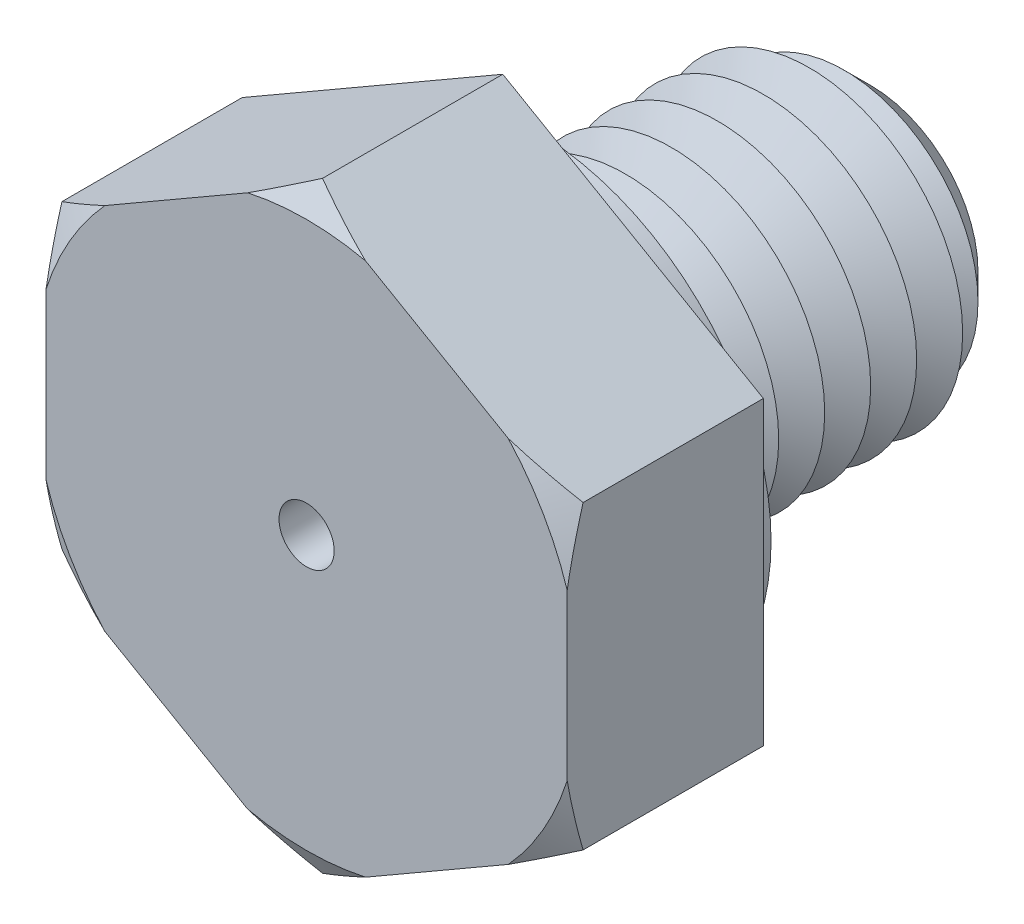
ISO-10303-21;
HEADER;
FILE_DESCRIPTION(('STEP AP214'),'2;1');
FILE_NAME('part.step','',(''),(''),'','','');
FILE_SCHEMA(('AUTOMOTIVE_DESIGN { 1 0 10303 214 1 1 1 1 }'));
ENDSEC;
DATA;
#1=APPLICATION_CONTEXT('core data for automotive mechanical design processes');
#2=APPLICATION_PROTOCOL_DEFINITION('international standard','automotive_design',2000,#1);
#3=PRODUCT_CONTEXT('',#1,'mechanical');
#4=PRODUCT('Part','Part','',(#3));
#5=PRODUCT_RELATED_PRODUCT_CATEGORY('part','',(#4));
#6=PRODUCT_DEFINITION_FORMATION('','',#4);
#7=PRODUCT_DEFINITION_CONTEXT('part definition',#1,'design');
#8=PRODUCT_DEFINITION('design','',#6,#7);
#9=PRODUCT_DEFINITION_SHAPE('','',#8);
#10=(LENGTH_UNIT() NAMED_UNIT(*) SI_UNIT(.MILLI.,.METRE.));
#11=(NAMED_UNIT(*) PLANE_ANGLE_UNIT() SI_UNIT($,.RADIAN.));
#12=(NAMED_UNIT(*) SI_UNIT($,.STERADIAN.) SOLID_ANGLE_UNIT());
#13=UNCERTAINTY_MEASURE_WITH_UNIT(LENGTH_MEASURE(1.E-05),#10,'distance_accuracy_value','');
#14=(GEOMETRIC_REPRESENTATION_CONTEXT(3) GLOBAL_UNCERTAINTY_ASSIGNED_CONTEXT((#13)) GLOBAL_UNIT_ASSIGNED_CONTEXT((#10,
#11,#12)) REPRESENTATION_CONTEXT('',''));
#15=CARTESIAN_POINT('',(0.,0.,0.));
#16=DIRECTION('',(0.,0.,1.));
#17=DIRECTION('',(1.,0.,0.));
#18=AXIS2_PLACEMENT_3D('',#15,#16,#17);
#19=CARTESIAN_POINT('',(8.5,4.90747728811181,6.4));
#20=DIRECTION('',(-0.5,-0.866025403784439,0.));
#21=DIRECTION('',(0.866025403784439,-0.5,0.));
#22=AXIS2_PLACEMENT_3D('',#19,#20,#21);
#23=PLANE('',#22);
#24=CARTESIAN_POINT('',(14.3974196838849,1.50260044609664,3.18954977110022));
#25=CARTESIAN_POINT('',(14.1303849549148,1.65677301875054,3.33361874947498));
#26=CARTESIAN_POINT('',(13.8627107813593,1.81131477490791,3.47613168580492));
#27=CARTESIAN_POINT('',(13.3258139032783,2.12129233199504,3.75731467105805));
#28=CARTESIAN_POINT('',(13.0565910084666,2.27672824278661,3.89598423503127));
#29=CARTESIAN_POINT('',(12.5155257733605,2.58911240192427,4.16915145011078));
#30=CARTESIAN_POINT('',(12.2436777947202,2.74606390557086,4.30363425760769));
#31=CARTESIAN_POINT('',(11.697943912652,3.06114350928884,4.56695627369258));
#32=CARTESIAN_POINT('',(11.4240580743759,3.21927157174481,4.69579566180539));
#33=CARTESIAN_POINT('',(10.8669438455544,3.54092162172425,4.94977636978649));
#34=CARTESIAN_POINT('',(10.5836547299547,3.70447866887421,5.07474091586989));
#35=CARTESIAN_POINT('',(10.0142178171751,4.03324322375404,5.31575754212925));
#36=CARTESIAN_POINT('',(9.72806988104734,4.19845081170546,5.43180918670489));
#37=CARTESIAN_POINT('',(9.15284957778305,4.53055440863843,5.6527883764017));
#38=CARTESIAN_POINT('',(8.86378033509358,4.69744861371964,5.75772666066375));
#39=CARTESIAN_POINT('',(8.28224800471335,5.03319646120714,5.95405449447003));
#40=CARTESIAN_POINT('',(7.98978536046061,5.20204984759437,6.04544579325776));
#41=CARTESIAN_POINT('',(7.29029341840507,5.60590170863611,6.24311258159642));
#42=CARTESIAN_POINT('',(6.88163396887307,5.84184135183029,6.34201308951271));
#43=CARTESIAN_POINT('',(6.2644717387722,6.1981601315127,6.46082851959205));
#44=CARTESIAN_POINT('',(6.05806549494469,6.31732883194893,6.49551015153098));
#45=CARTESIAN_POINT('',(5.64409758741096,6.55633331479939,6.55416143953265));
#46=CARTESIAN_POINT('',(5.43653593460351,6.67616909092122,6.57813119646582));
#47=CARTESIAN_POINT('',(5.02306823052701,6.914884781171,6.6144556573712));
#48=CARTESIAN_POINT('',(4.81717088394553,7.03375966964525,6.62694180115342));
#49=CARTESIAN_POINT('',(4.40509314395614,7.27167286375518,6.64040244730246));
#50=CARTESIAN_POINT('',(4.19891275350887,7.39071116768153,6.64137706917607));
#51=CARTESIAN_POINT('',(3.78675559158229,7.62867021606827,6.63178359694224));
#52=CARTESIAN_POINT('',(3.58077881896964,7.747590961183,6.62121556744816));
#53=CARTESIAN_POINT('',(3.16946579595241,7.9850626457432,6.58885652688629));
#54=CARTESIAN_POINT('',(2.96412965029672,8.10361352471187,6.56706376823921));
#55=CARTESIAN_POINT('',(2.47890311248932,8.38375919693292,6.50285520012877));
#56=CARTESIAN_POINT('',(2.19947000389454,8.54508997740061,6.45579627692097));
#57=CARTESIAN_POINT('',(1.6432817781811,8.86620539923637,6.34397240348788));
#58=CARTESIAN_POINT('',(1.36652705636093,9.02598981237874,6.27920487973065));
#59=CARTESIAN_POINT('',(0.815728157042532,9.34399370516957,6.13440902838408));
#60=CARTESIAN_POINT('',(0.541687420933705,9.50221119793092,6.05436342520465));
#61=CARTESIAN_POINT('',(-0.00331670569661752,9.81686947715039,5.88153285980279));
#62=CARTESIAN_POINT('',(-0.274280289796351,9.97331037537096,5.788748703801));
#63=CARTESIAN_POINT('',(-0.816522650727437,10.2863741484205,5.59147835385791));
#64=CARTESIAN_POINT('',(-1.08776675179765,10.4429770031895,5.48686595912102));
#65=CARTESIAN_POINT('',(-1.62738149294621,10.7545237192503,5.26886764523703));
#66=CARTESIAN_POINT('',(-1.89575390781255,10.9094686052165,5.15548754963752));
#67=CARTESIAN_POINT('',(-2.43005320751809,11.2179464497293,4.92150983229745));
#68=CARTESIAN_POINT('',(-2.69598059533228,11.3714796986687,4.80091373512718));
#69=CARTESIAN_POINT('',(-3.22575115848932,11.6773428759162,4.55376737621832));
#70=CARTESIAN_POINT('',(-3.48959429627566,11.829672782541,4.42721700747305));
#71=CARTESIAN_POINT('',(-3.9337259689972,12.0860923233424,4.20929972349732));
#72=CARTESIAN_POINT('',(-4.11449197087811,12.1904576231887,4.11922480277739));
#73=CARTESIAN_POINT('',(-4.47523725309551,12.3987340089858,3.93701701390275));
#74=CARTESIAN_POINT('',(-4.6552165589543,12.5026451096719,3.84488421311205));
#75=CARTESIAN_POINT('',(-5.01258669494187,12.7089728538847,3.65977671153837));
#76=CARTESIAN_POINT('',(-5.18998489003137,12.8113937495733,3.56682094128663));
#77=CARTESIAN_POINT('',(-5.54415606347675,13.0158745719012,3.3793246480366));
#78=CARTESIAN_POINT('',(-5.72092903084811,13.1179344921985,3.28478409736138));
#79=CARTESIAN_POINT('',(-5.89741968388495,13.2198314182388,3.18954977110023));
#80=B_SPLINE_CURVE_WITH_KNOTS('',3,(#24,#25,#26,#27,#28,#29,#30,#31,#32,#33,#34,#35,#36,#37,#38,
#39,#40,#41,#42,#43,#44,#45,#46,#47,#48,#49,#50,#51,#52,#53,#54,#55,#56,#57,#58,#59,#60,#61,#62,
#63,#64,#65,#66,#67,#68,#69,#70,#71,#72,#73,#74,#75,#76,#77,#78,#79),.UNSPECIFIED.,.F.,.F.,(4,2,
2,2,2,2,2,2,2,2,2,2,2,2,2,2,2,2,2,2,2,2,2,2,2,2,2,4),(0.,1.02103660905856,2.04220146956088,
3.06664888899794,4.09106369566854,5.1414707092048,6.19192902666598,7.24136281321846,
8.29066097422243,9.73548564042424,10.45782862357,11.1801648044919,11.8941264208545,
12.6080806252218,13.3220308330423,14.036092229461,15.0137259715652,15.9915018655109,
16.9703899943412,17.9492161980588,18.939699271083,19.9295300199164,20.9191523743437,
21.9087925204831,22.5907917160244,23.272768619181,23.947601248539,24.622445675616),.UNSPECIFIED.);
#81=CARTESIAN_POINT('',(8.5,4.90747728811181,5.88038475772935));
#82=VERTEX_POINT('',#81);
#83=CARTESIAN_POINT('',(6.57804882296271,6.01711631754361,6.4));
#84=VERTEX_POINT('',#83);
#85=EDGE_CURVE('E132',#82,#84,#80,.T.);
#86=ORIENTED_EDGE('',*,*,#85,.F.);
#87=DIRECTION('',(0.,0.,-1.));
#88=VECTOR('',#87,1.);
#89=CARTESIAN_POINT('',(8.5,4.90747728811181,6.4));
#90=LINE('',#89,#88);
#91=CARTESIAN_POINT('',(8.5,4.90747728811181,0.));
#92=VERTEX_POINT('',#91);
#93=EDGE_CURVE('E144',#82,#92,#90,.T.);
#94=ORIENTED_EDGE('',*,*,#93,.T.);
#95=DIRECTION('',(-0.866025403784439,0.5,0.));
#96=VECTOR('',#95,1.);
#97=CARTESIAN_POINT('',(8.5,4.90747728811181,0.));
#98=LINE('',#97,#96);
#99=CARTESIAN_POINT('',(0.,9.81495457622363,0.));
#100=VERTEX_POINT('',#99);
#101=EDGE_CURVE('E256',#92,#100,#98,.T.);
#102=ORIENTED_EDGE('',*,*,#101,.T.);
#103=DIRECTION('',(0.,0.,-1.));
#104=VECTOR('',#103,1.);
#105=CARTESIAN_POINT('',(0.,9.81495457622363,6.4));
#106=LINE('',#105,#104);
#107=CARTESIAN_POINT('',(0.,9.81495457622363,5.88038475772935));
#108=VERTEX_POINT('',#107);
#109=EDGE_CURVE('E177',#108,#100,#106,.T.);
#110=ORIENTED_EDGE('',*,*,#109,.F.);
#111=CARTESIAN_POINT('',(1.92195117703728,8.70531554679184,6.4));
#112=VERTEX_POINT('',#111);
#113=EDGE_CURVE('E151',#112,#108,#80,.T.);
#114=ORIENTED_EDGE('',*,*,#113,.F.);
#115=DIRECTION('',(-0.866025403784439,0.5,0.));
#116=VECTOR('',#115,1.);
#117=CARTESIAN_POINT('',(8.5,4.90747728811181,6.4));
#118=LINE('',#117,#116);
#119=EDGE_CURVE('E148',#84,#112,#118,.T.);
#120=ORIENTED_EDGE('',*,*,#119,.F.);
#121=EDGE_LOOP('',(#86,#94,#102,#110,#114,#120));
#122=FACE_BOUND('',#121,.T.);
#123=ADVANCED_FACE('F39',(#122),#23,.F.);
#124=CARTESIAN_POINT('',(0.,9.81495457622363,6.4));
#125=DIRECTION('',(0.5,-0.866025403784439,0.));
#126=DIRECTION('',(0.866025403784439,0.5,0.));
#127=AXIS2_PLACEMENT_3D('',#124,#125,#126);
#128=PLANE('',#127);
#129=CARTESIAN_POINT('',(5.89741968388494,13.2198314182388,3.18954977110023));
#130=CARTESIAN_POINT('',(5.63038495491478,13.0656588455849,3.33361874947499));
#131=CARTESIAN_POINT('',(5.36271078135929,12.9111170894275,3.47613168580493));
#132=CARTESIAN_POINT('',(4.82581390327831,12.6011395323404,3.75731467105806));
#133=CARTESIAN_POINT('',(4.55659100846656,12.4457036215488,3.89598423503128));
#134=CARTESIAN_POINT('',(4.01552577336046,12.1333194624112,4.16915145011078));
#135=CARTESIAN_POINT('',(3.74367779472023,11.9763679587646,4.30363425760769));
#136=CARTESIAN_POINT('',(3.19794391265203,11.6612883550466,4.56695627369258));
#137=CARTESIAN_POINT('',(2.92405807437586,11.5031602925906,4.69579566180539));
#138=CARTESIAN_POINT('',(2.3669438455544,11.1815102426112,4.9497763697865));
#139=CARTESIAN_POINT('',(2.08365472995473,11.0179531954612,5.0747409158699));
#140=CARTESIAN_POINT('',(1.51421781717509,10.6891886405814,5.31575754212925));
#141=CARTESIAN_POINT('',(1.22806988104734,10.52398105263,5.4318091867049));
#142=CARTESIAN_POINT('',(0.652849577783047,10.191877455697,5.6527883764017));
#143=CARTESIAN_POINT('',(0.363780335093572,10.0249832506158,5.75772666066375));
#144=CARTESIAN_POINT('',(-0.21775199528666,9.6892354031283,5.95405449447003));
#145=CARTESIAN_POINT('',(-0.510214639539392,9.52038201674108,6.04544579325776));
#146=CARTESIAN_POINT('',(-1.20970658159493,9.11653015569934,6.24311258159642));
#147=CARTESIAN_POINT('',(-1.61836603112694,8.88059051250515,6.34201308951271));
#148=CARTESIAN_POINT('',(-2.2355282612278,8.52427173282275,6.46082851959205));
#149=CARTESIAN_POINT('',(-2.44193450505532,8.40510303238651,6.49551015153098));
#150=CARTESIAN_POINT('',(-2.85590241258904,8.16609854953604,6.55416143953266));
#151=CARTESIAN_POINT('',(-3.0634640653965,8.04626277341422,6.57813119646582));
#152=CARTESIAN_POINT('',(-3.47693176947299,7.80754708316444,6.6144556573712));
#153=CARTESIAN_POINT('',(-3.68282911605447,7.68867219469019,6.62694180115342));
#154=CARTESIAN_POINT('',(-4.09490685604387,7.45075900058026,6.64040244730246));
#155=CARTESIAN_POINT('',(-4.30108724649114,7.33172069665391,6.64137706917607));
#156=CARTESIAN_POINT('',(-4.71324440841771,7.09376164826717,6.63178359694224));
#157=CARTESIAN_POINT('',(-4.91922118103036,6.97484090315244,6.62121556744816));
#158=CARTESIAN_POINT('',(-5.3305342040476,6.73736921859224,6.58885652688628));
#159=CARTESIAN_POINT('',(-5.53587034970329,6.61881833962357,6.5670637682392));
#160=CARTESIAN_POINT('',(-6.02109688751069,6.33867266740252,6.50285520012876));
#161=CARTESIAN_POINT('',(-6.30052999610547,6.17734188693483,6.45579627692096));
#162=CARTESIAN_POINT('',(-6.85671822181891,5.85622646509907,6.34397240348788));
#163=CARTESIAN_POINT('',(-7.13347294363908,5.6964420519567,6.27920487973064));
#164=CARTESIAN_POINT('',(-7.68427184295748,5.37843815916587,6.13440902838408));
#165=CARTESIAN_POINT('',(-7.9583125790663,5.22022066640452,6.05436342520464));
#166=CARTESIAN_POINT('',(-8.50331670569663,4.90556238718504,5.88153285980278));
#167=CARTESIAN_POINT('',(-8.77428028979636,4.74912148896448,5.78874870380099));
#168=CARTESIAN_POINT('',(-9.31652265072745,4.4360577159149,5.59147835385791));
#169=CARTESIAN_POINT('',(-9.58776675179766,4.27945486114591,5.48686595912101));
#170=CARTESIAN_POINT('',(-10.1273814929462,3.9679081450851,5.26886764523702));
#171=CARTESIAN_POINT('',(-10.3957539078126,3.81296325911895,5.15548754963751));
#172=CARTESIAN_POINT('',(-10.9300532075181,3.50448541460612,4.92150983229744));
#173=CARTESIAN_POINT('',(-11.1959805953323,3.35095216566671,4.80091373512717));
#174=CARTESIAN_POINT('',(-11.7257511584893,3.04508898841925,4.55376737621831));
#175=CARTESIAN_POINT('',(-11.9895942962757,2.89275908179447,4.42721700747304));
#176=CARTESIAN_POINT('',(-12.4337259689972,2.63633954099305,4.20929972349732));
#177=CARTESIAN_POINT('',(-12.6144919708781,2.53197424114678,4.11922480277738));
#178=CARTESIAN_POINT('',(-12.9752372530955,2.32369785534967,3.93701701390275));
#179=CARTESIAN_POINT('',(-13.1552165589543,2.21978675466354,3.84488421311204));
#180=CARTESIAN_POINT('',(-13.5125866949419,2.01345901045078,3.65977671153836));
#181=CARTESIAN_POINT('',(-13.6899848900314,1.91103811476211,3.56682094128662));
#182=CARTESIAN_POINT('',(-14.0441560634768,1.70655729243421,3.37932464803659));
#183=CARTESIAN_POINT('',(-14.2209290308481,1.60449737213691,3.28478409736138));
#184=CARTESIAN_POINT('',(-14.3974196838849,1.50260044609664,3.18954977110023));
#185=B_SPLINE_CURVE_WITH_KNOTS('',3,(#129,#130,#131,#132,#133,#134,#135,#136,#137,#138,#139,
#140,#141,#142,#143,#144,#145,#146,#147,#148,#149,#150,#151,#152,#153,#154,#155,#156,#157,#158,
#159,#160,#161,#162,#163,#164,#165,#166,#167,#168,#169,#170,#171,#172,#173,#174,#175,#176,#177,
#178,#179,#180,#181,#182,#183,#184),.UNSPECIFIED.,.F.,.F.,(4,2,2,2,2,2,2,2,2,2,2,2,2,2,2,2,2,2,
2,2,2,2,2,2,2,2,2,4),(0.,1.02103660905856,2.04220146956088,3.06664888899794,4.09106369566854,
5.14147070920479,6.19192902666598,7.24136281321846,8.29066097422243,9.73548564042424,
10.45782862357,11.1801648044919,11.8941264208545,12.6080806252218,13.3220308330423,
14.036092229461,15.0137259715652,15.991501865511,16.9703899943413,17.9492161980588,
18.939699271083,19.9295300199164,20.9191523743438,21.9087925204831,22.5907917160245,
23.272768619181,23.947601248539,24.622445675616),.UNSPECIFIED.);
#186=CARTESIAN_POINT('',(-1.92195117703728,8.70531554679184,6.4));
#187=VERTEX_POINT('',#186);
#188=EDGE_CURVE('E310',#108,#187,#185,.T.);
#189=ORIENTED_EDGE('',*,*,#188,.F.);
#190=ORIENTED_EDGE('',*,*,#109,.T.);
#191=DIRECTION('',(-0.866025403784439,-0.5,0.));
#192=VECTOR('',#191,1.);
#193=CARTESIAN_POINT('',(0.,9.81495457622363,0.));
#194=LINE('',#193,#192);
#195=CARTESIAN_POINT('',(-8.5,4.90747728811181,0.));
#196=VERTEX_POINT('',#195);
#197=EDGE_CURVE('E276',#100,#196,#194,.T.);
#198=ORIENTED_EDGE('',*,*,#197,.T.);
#199=DIRECTION('',(0.,0.,-1.));
#200=VECTOR('',#199,1.);
#201=CARTESIAN_POINT('',(-8.5,4.90747728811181,6.4));
#202=LINE('',#201,#200);
#203=CARTESIAN_POINT('',(-8.5,4.90747728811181,5.88038475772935));
#204=VERTEX_POINT('',#203);
#205=EDGE_CURVE('E174',#204,#196,#202,.T.);
#206=ORIENTED_EDGE('',*,*,#205,.F.);
#207=CARTESIAN_POINT('',(-6.57804882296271,6.01711631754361,6.4));
#208=VERTEX_POINT('',#207);
#209=EDGE_CURVE('E304',#208,#204,#185,.T.);
#210=ORIENTED_EDGE('',*,*,#209,.F.);
#211=DIRECTION('',(-0.866025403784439,-0.5,0.));
#212=VECTOR('',#211,1.);
#213=CARTESIAN_POINT('',(0.,9.81495457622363,6.4));
#214=LINE('',#213,#212);
#215=EDGE_CURVE('E259',#187,#208,#214,.T.);
#216=ORIENTED_EDGE('',*,*,#215,.F.);
#217=EDGE_LOOP('',(#189,#190,#198,#206,#210,#216));
#218=FACE_BOUND('',#217,.T.);
#219=ADVANCED_FACE('F360',(#218),#128,.F.);
#220=CARTESIAN_POINT('',(-8.5,4.90747728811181,6.4));
#221=DIRECTION('',(1.,0.,0.));
#222=DIRECTION('',(0.,0.,-1.));
#223=AXIS2_PLACEMENT_3D('',#220,#221,#222);
#224=PLANE('',#223);
#225=CARTESIAN_POINT('',(-8.5,10.8048969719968,3.60988571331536));
#226=CARTESIAN_POINT('',(-8.5,10.4978348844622,3.74918346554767));
#227=CARTESIAN_POINT('',(-8.5,10.189932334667,3.88666386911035));
#228=CARTESIAN_POINT('',(-8.5,9.57208629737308,4.15710808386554));
#229=CARTESIAN_POINT('',(-8.5,9.26214245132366,4.29007107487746));
#230=CARTESIAN_POINT('',(-8.5,8.6386633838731,4.55109231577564));
#231=CARTESIAN_POINT('',(-8.5,8.32511856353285,4.67912772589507));
#232=CARTESIAN_POINT('',(-8.5,7.69537699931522,4.92848462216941));
#233=CARTESIAN_POINT('',(-8.5,7.37918037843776,5.04980641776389));
#234=CARTESIAN_POINT('',(-8.5,6.74517674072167,5.28371307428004));
#235=CARTESIAN_POINT('',(-8.5,6.42738342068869,5.39633487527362));
#236=CARTESIAN_POINT('',(-8.5,5.78839893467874,5.61161420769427));
#237=CARTESIAN_POINT('',(-8.5,5.46720760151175,5.7142712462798));
#238=CARTESIAN_POINT('',(-8.5,4.82159629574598,5.90726308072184));
#239=CARTESIAN_POINT('',(-8.5,4.49718135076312,5.99761456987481));
#240=CARTESIAN_POINT('',(-8.5,3.84456693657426,6.16359045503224));
#241=CARTESIAN_POINT('',(-8.5,3.51636763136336,6.23921548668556));
#242=CARTESIAN_POINT('',(-8.5,2.94974096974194,6.35404738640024));
#243=CARTESIAN_POINT('',(-8.5,2.7121746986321,6.39750509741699));
#244=CARTESIAN_POINT('',(-8.5,2.23545236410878,6.47441576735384));
#245=CARTESIAN_POINT('',(-8.5,1.99629657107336,6.50787038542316));
#246=CARTESIAN_POINT('',(-8.5,1.51674855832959,6.56389930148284));
#247=CARTESIAN_POINT('',(-8.5,1.27635657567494,6.58647561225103));
#248=CARTESIAN_POINT('',(-8.5,0.794760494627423,6.62010098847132));
#249=CARTESIAN_POINT('',(-8.5,0.553556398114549,6.63115008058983));
#250=CARTESIAN_POINT('',(-8.5,0.0710159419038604,6.64137634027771));
#251=CARTESIAN_POINT('',(-8.5,-0.170320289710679,6.64055949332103));
#252=CARTESIAN_POINT('',(-8.5,-0.65265778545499,6.62709447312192));
#253=CARTESIAN_POINT('',(-8.5,-0.893659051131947,6.6144463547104));
#254=CARTESIAN_POINT('',(-8.5,-1.37480632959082,6.57770491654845));
#255=CARTESIAN_POINT('',(-8.5,-1.61495224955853,6.55361039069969));
#256=CARTESIAN_POINT('',(-8.5,-2.09391419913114,6.49466927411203));
#257=CARTESIAN_POINT('',(-8.5,-2.33273017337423,6.4598222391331));
#258=CARTESIAN_POINT('',(-8.5,-2.92716537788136,6.36046793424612));
#259=CARTESIAN_POINT('',(-8.5,-3.28176466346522,6.28983043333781));
#260=CARTESIAN_POINT('',(-8.5,-3.98672843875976,6.12983266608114));
#261=CARTESIAN_POINT('',(-8.5,-4.3370917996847,6.0404675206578));
#262=CARTESIAN_POINT('',(-8.5,-5.0342542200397,5.84616571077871));
#263=CARTESIAN_POINT('',(-8.5,-5.3810438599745,5.74119557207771));
#264=CARTESIAN_POINT('',(-8.5,-6.07054103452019,5.51879279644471));
#265=CARTESIAN_POINT('',(-8.5,-6.41324885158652,5.40136102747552));
#266=CARTESIAN_POINT('',(-8.5,-7.09891821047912,5.15508322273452));
#267=CARTESIAN_POINT('',(-8.5,-7.44183833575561,5.02612259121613));
#268=CARTESIAN_POINT('',(-8.5,-8.12447486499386,4.75996128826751));
#269=CARTESIAN_POINT('',(-8.5,-8.46419106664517,4.62276010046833));
#270=CARTESIAN_POINT('',(-8.5,-9.13876623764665,4.34260011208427));
#271=CARTESIAN_POINT('',(-8.5,-9.47364225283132,4.19968216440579));
#272=CARTESIAN_POINT('',(-8.5,-10.1409696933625,3.90850505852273));
#273=CARTESIAN_POINT('',(-8.5,-10.4734216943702,3.76024722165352));
#274=CARTESIAN_POINT('',(-8.5,-10.8048969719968,3.60988571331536));
#275=B_SPLINE_CURVE_WITH_KNOTS('',3,(#225,#226,#227,#228,#229,#230,#231,#232,#233,#234,#235,
#236,#237,#238,#239,#240,#241,#242,#243,#244,#245,#246,#247,#248,#249,#250,#251,#252,#253,#254,
#255,#256,#257,#258,#259,#260,#261,#262,#263,#264,#265,#266,#267,#268,#269,#270,#271,#272,#273,
#274),.UNSPECIFIED.,.F.,.F.,(4,2,2,2,2,2,2,2,2,2,2,2,2,2,2,2,2,2,2,2,2,2,2,2,4),(0.,
1.01155870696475,2.02330010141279,3.03927305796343,4.05519914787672,5.06654285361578,
6.07793655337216,7.08794426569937,8.09790837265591,8.82224854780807,9.5464685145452,
10.2705544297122,10.9946386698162,11.7183576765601,12.4420733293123,13.1658652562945,
13.8896870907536,14.9737367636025,16.0580692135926,17.1447621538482,18.2313794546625,
19.3303511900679,20.4293918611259,21.5216359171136,22.6136115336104),.UNSPECIFIED.);
#276=CARTESIAN_POINT('',(-8.5,2.68819922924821,6.4));
#277=VERTEX_POINT('',#276);
#278=EDGE_CURVE('E303',#204,#277,#275,.T.);
#279=ORIENTED_EDGE('',*,*,#278,.F.);
#280=ORIENTED_EDGE('',*,*,#205,.T.);
#281=DIRECTION('',(0.,-1.,0.));
#282=VECTOR('',#281,1.);
#283=CARTESIAN_POINT('',(-8.5,4.90747728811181,0.));
#284=LINE('',#283,#282);
#285=CARTESIAN_POINT('',(-8.5,-4.90747728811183,0.));
#286=VERTEX_POINT('',#285);
#287=EDGE_CURVE('E280',#196,#286,#284,.T.);
#288=ORIENTED_EDGE('',*,*,#287,.T.);
#289=DIRECTION('',(0.,0.,-1.));
#290=VECTOR('',#289,1.);
#291=CARTESIAN_POINT('',(-8.5,-4.90747728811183,6.4));
#292=LINE('',#291,#290);
#293=CARTESIAN_POINT('',(-8.49999999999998,-4.90747728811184,5.88038475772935));
#294=VERTEX_POINT('',#293);
#295=EDGE_CURVE('E172',#294,#286,#292,.T.);
#296=ORIENTED_EDGE('',*,*,#295,.F.);
#297=CARTESIAN_POINT('',(-8.5,-2.68819922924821,6.4));
#298=VERTEX_POINT('',#297);
#299=EDGE_CURVE('E305',#298,#294,#275,.T.);
#300=ORIENTED_EDGE('',*,*,#299,.F.);
#301=DIRECTION('',(0.,-1.,0.));
#302=VECTOR('',#301,1.);
#303=CARTESIAN_POINT('',(-8.5,4.90747728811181,6.4));
#304=LINE('',#303,#302);
#305=EDGE_CURVE('E263',#277,#298,#304,.T.);
#306=ORIENTED_EDGE('',*,*,#305,.F.);
#307=EDGE_LOOP('',(#279,#280,#288,#296,#300,#306));
#308=FACE_BOUND('',#307,.T.);
#309=ADVANCED_FACE('F356',(#308),#224,.F.);
#310=CARTESIAN_POINT('',(-8.5,-4.90747728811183,6.4));
#311=DIRECTION('',(0.5,0.866025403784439,0.));
#312=DIRECTION('',(-0.866025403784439,0.5,0.));
#313=AXIS2_PLACEMENT_3D('',#310,#311,#312);
#314=PLANE('',#313);
#315=CARTESIAN_POINT('',(-14.3974196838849,-1.50260044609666,3.18954977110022));
#316=CARTESIAN_POINT('',(-14.1303849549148,-1.65677301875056,3.33361874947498));
#317=CARTESIAN_POINT('',(-13.8627107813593,-1.81131477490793,3.47613168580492));
#318=CARTESIAN_POINT('',(-13.3258139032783,-2.12129233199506,3.75731467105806));
#319=CARTESIAN_POINT('',(-13.0565910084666,-2.27672824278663,3.89598423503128));
#320=CARTESIAN_POINT('',(-12.5155257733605,-2.58911240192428,4.16915145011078));
#321=CARTESIAN_POINT('',(-12.2436777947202,-2.74606390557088,4.30363425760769));
#322=CARTESIAN_POINT('',(-11.697943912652,-3.06114350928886,4.56695627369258));
#323=CARTESIAN_POINT('',(-11.4240580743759,-3.21927157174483,4.69579566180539));
#324=CARTESIAN_POINT('',(-10.8669438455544,-3.54092162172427,4.94977636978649));
#325=CARTESIAN_POINT('',(-10.5836547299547,-3.70447866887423,5.07474091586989));
#326=CARTESIAN_POINT('',(-10.0142178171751,-4.03324322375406,5.31575754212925));
#327=CARTESIAN_POINT('',(-9.72806988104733,-4.19845081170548,5.43180918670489));
#328=CARTESIAN_POINT('',(-9.15284957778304,-4.53055440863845,5.65278837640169));
#329=CARTESIAN_POINT('',(-8.86378033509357,-4.69744861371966,5.75772666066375));
#330=CARTESIAN_POINT('',(-8.28224800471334,-5.03319646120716,5.95405449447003));
#331=CARTESIAN_POINT('',(-7.9897853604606,-5.20204984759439,6.04544579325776));
#332=CARTESIAN_POINT('',(-7.29029341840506,-5.60590170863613,6.24311258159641));
#333=CARTESIAN_POINT('',(-6.88163396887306,-5.84184135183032,6.34201308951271));
#334=CARTESIAN_POINT('',(-6.26447173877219,-6.19816013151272,6.46082851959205));
#335=CARTESIAN_POINT('',(-6.05806549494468,-6.31732883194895,6.49551015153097));
#336=CARTESIAN_POINT('',(-5.64409758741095,-6.55633331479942,6.55416143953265));
#337=CARTESIAN_POINT('',(-5.4365359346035,-6.67616909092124,6.57813119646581));
#338=CARTESIAN_POINT('',(-5.023068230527,-6.91488478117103,6.6144556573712));
#339=CARTESIAN_POINT('',(-4.81717088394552,-7.03375966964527,6.62694180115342));
#340=CARTESIAN_POINT('',(-4.40509314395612,-7.2716728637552,6.64040244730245));
#341=CARTESIAN_POINT('',(-4.19891275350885,-7.39071116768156,6.64137706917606));
#342=CARTESIAN_POINT('',(-3.78675559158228,-7.6286702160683,6.63178359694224));
#343=CARTESIAN_POINT('',(-3.58077881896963,-7.74759096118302,6.62121556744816));
#344=CARTESIAN_POINT('',(-3.16946579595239,-7.98506264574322,6.58885652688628));
#345=CARTESIAN_POINT('',(-2.9641296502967,-8.10361352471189,6.5670637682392));
#346=CARTESIAN_POINT('',(-2.4789031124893,-8.38375919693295,6.50285520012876));
#347=CARTESIAN_POINT('',(-2.19947000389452,-8.54508997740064,6.45579627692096));
#348=CARTESIAN_POINT('',(-1.64328177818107,-8.8662053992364,6.34397240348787));
#349=CARTESIAN_POINT('',(-1.36652705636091,-9.02598981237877,6.27920487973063));
#350=CARTESIAN_POINT('',(-0.815728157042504,-9.3439937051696,6.13440902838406));
#351=CARTESIAN_POINT('',(-0.541687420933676,-9.50221119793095,6.05436342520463));
#352=CARTESIAN_POINT('',(0.00331670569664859,-9.81686947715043,5.88153285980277));
#353=CARTESIAN_POINT('',(0.274280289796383,-9.973310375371,5.78874870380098));
#354=CARTESIAN_POINT('',(0.81652265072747,-10.2863741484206,5.59147835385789));
#355=CARTESIAN_POINT('',(1.08776675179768,-10.4429770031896,5.486865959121));
#356=CARTESIAN_POINT('',(1.62738149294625,-10.7545237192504,5.268867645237));
#357=CARTESIAN_POINT('',(1.89575390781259,-10.9094686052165,5.15548754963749));
#358=CARTESIAN_POINT('',(2.43005320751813,-11.2179464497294,4.92150983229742));
#359=CARTESIAN_POINT('',(2.69598059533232,-11.3714796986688,4.80091373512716));
#360=CARTESIAN_POINT('',(3.22575115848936,-11.6773428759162,4.55376737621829));
#361=CARTESIAN_POINT('',(3.48959429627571,-11.829672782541,4.42721700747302));
#362=CARTESIAN_POINT('',(3.93372596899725,-12.0860923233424,4.20929972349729));
#363=CARTESIAN_POINT('',(4.11449197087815,-12.1904576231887,4.11922480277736));
#364=CARTESIAN_POINT('',(4.47523725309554,-12.3987340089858,3.93701701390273));
#365=CARTESIAN_POINT('',(4.65521655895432,-12.5026451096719,3.84488421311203));
#366=CARTESIAN_POINT('',(5.01258669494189,-12.7089728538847,3.65977671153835));
#367=CARTESIAN_POINT('',(5.18998489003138,-12.8113937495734,3.56682094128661));
#368=CARTESIAN_POINT('',(5.54415606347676,-13.0158745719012,3.37932464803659));
#369=CARTESIAN_POINT('',(5.72092903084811,-13.1179344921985,3.28478409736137));
#370=CARTESIAN_POINT('',(5.89741968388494,-13.2198314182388,3.18954977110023));
#371=B_SPLINE_CURVE_WITH_KNOTS('',3,(#315,#316,#317,#318,#319,#320,#321,#322,#323,#324,#325,
#326,#327,#328,#329,#330,#331,#332,#333,#334,#335,#336,#337,#338,#339,#340,#341,#342,#343,#344,
#345,#346,#347,#348,#349,#350,#351,#352,#353,#354,#355,#356,#357,#358,#359,#360,#361,#362,#363,
#364,#365,#366,#367,#368,#369,#370),.UNSPECIFIED.,.F.,.F.,(4,2,2,2,2,2,2,2,2,2,2,2,2,2,2,2,2,2,
2,2,2,2,2,2,2,2,2,4),(0.,1.02103660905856,2.04220146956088,3.06664888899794,4.09106369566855,
5.1414707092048,6.19192902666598,7.24136281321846,8.29066097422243,9.73548564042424,
10.45782862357,11.1801648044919,11.8941264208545,12.6080806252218,13.3220308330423,
14.036092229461,15.0137259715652,15.991501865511,16.9703899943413,17.9492161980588,
18.939699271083,19.9295300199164,20.9191523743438,21.9087925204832,22.5907917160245,
23.272768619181,23.947601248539,24.622445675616),.UNSPECIFIED.);
#372=CARTESIAN_POINT('',(-6.57804882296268,-6.01711631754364,6.4));
#373=VERTEX_POINT('',#372);
#374=EDGE_CURVE('E309',#294,#373,#371,.T.);
#375=ORIENTED_EDGE('',*,*,#374,.F.);
#376=ORIENTED_EDGE('',*,*,#295,.T.);
#377=DIRECTION('',(0.866025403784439,-0.5,0.));
#378=VECTOR('',#377,1.);
#379=CARTESIAN_POINT('',(-8.5,-4.90747728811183,0.));
#380=LINE('',#379,#378);
#381=CARTESIAN_POINT('',(0.,-9.81495457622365,0.));
#382=VERTEX_POINT('',#381);
#383=EDGE_CURVE('E284',#286,#382,#380,.T.);
#384=ORIENTED_EDGE('',*,*,#383,.T.);
#385=DIRECTION('',(0.,0.,-1.));
#386=VECTOR('',#385,1.);
#387=CARTESIAN_POINT('',(0.,-9.81495457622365,6.4));
#388=LINE('',#387,#386);
#389=CARTESIAN_POINT('',(0.,-9.81495457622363,5.88038475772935));
#390=VERTEX_POINT('',#389);
#391=EDGE_CURVE('E162',#390,#382,#388,.T.);
#392=ORIENTED_EDGE('',*,*,#391,.F.);
#393=CARTESIAN_POINT('',(-1.92195117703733,-8.70531554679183,6.4));
#394=VERTEX_POINT('',#393);
#395=EDGE_CURVE('E344',#394,#390,#371,.T.);
#396=ORIENTED_EDGE('',*,*,#395,.F.);
#397=DIRECTION('',(0.866025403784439,-0.5,0.));
#398=VECTOR('',#397,1.);
#399=CARTESIAN_POINT('',(-8.5,-4.90747728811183,6.4));
#400=LINE('',#399,#398);
#401=EDGE_CURVE('E267',#373,#394,#400,.T.);
#402=ORIENTED_EDGE('',*,*,#401,.F.);
#403=EDGE_LOOP('',(#375,#376,#384,#392,#396,#402));
#404=FACE_BOUND('',#403,.T.);
#405=ADVANCED_FACE('F359',(#404),#314,.F.);
#406=CARTESIAN_POINT('',(0.,-9.81495457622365,6.4));
#407=DIRECTION('',(-0.5,0.866025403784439,0.));
#408=DIRECTION('',(-0.866025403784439,-0.5,0.));
#409=AXIS2_PLACEMENT_3D('',#406,#407,#408);
#410=PLANE('',#409);
#411=CARTESIAN_POINT('',(-5.89741968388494,-13.2198314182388,3.18954977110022));
#412=CARTESIAN_POINT('',(-5.63038495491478,-13.0656588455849,3.33361874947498));
#413=CARTESIAN_POINT('',(-5.36271078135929,-12.9111170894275,3.47613168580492));
#414=CARTESIAN_POINT('',(-4.8258139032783,-12.6011395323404,3.75731467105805));
#415=CARTESIAN_POINT('',(-4.55659100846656,-12.4457036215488,3.89598423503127));
#416=CARTESIAN_POINT('',(-4.01552577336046,-12.1333194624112,4.16915145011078));
#417=CARTESIAN_POINT('',(-3.74367779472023,-11.9763679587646,4.30363425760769));
#418=CARTESIAN_POINT('',(-3.19794391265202,-11.6612883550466,4.56695627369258));
#419=CARTESIAN_POINT('',(-2.92405807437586,-11.5031602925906,4.69579566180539));
#420=CARTESIAN_POINT('',(-2.36694384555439,-11.1815102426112,4.94977636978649));
#421=CARTESIAN_POINT('',(-2.08365472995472,-11.0179531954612,5.07474091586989));
#422=CARTESIAN_POINT('',(-1.51421781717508,-10.6891886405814,5.31575754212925));
#423=CARTESIAN_POINT('',(-1.22806988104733,-10.52398105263,5.43180918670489));
#424=CARTESIAN_POINT('',(-0.652849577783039,-10.191877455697,5.65278837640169));
#425=CARTESIAN_POINT('',(-0.363780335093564,-10.0249832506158,5.75772666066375));
#426=CARTESIAN_POINT('',(0.217751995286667,-9.68923540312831,5.95405449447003));
#427=CARTESIAN_POINT('',(0.5102146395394,-9.52038201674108,6.04544579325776));
#428=CARTESIAN_POINT('',(1.20970658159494,-9.11653015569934,6.24311258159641));
#429=CARTESIAN_POINT('',(1.61836603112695,-8.88059051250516,6.34201308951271));
#430=CARTESIAN_POINT('',(2.23552826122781,-8.52427173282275,6.46082851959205));
#431=CARTESIAN_POINT('',(2.44193450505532,-8.40510303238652,6.49551015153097));
#432=CARTESIAN_POINT('',(2.85590241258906,-8.16609854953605,6.55416143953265));
#433=CARTESIAN_POINT('',(3.06346406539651,-8.04626277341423,6.57813119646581));
#434=CARTESIAN_POINT('',(3.47693176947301,-7.80754708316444,6.61445565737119));
#435=CARTESIAN_POINT('',(3.68282911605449,-7.6886721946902,6.62694180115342));
#436=CARTESIAN_POINT('',(4.09490685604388,-7.45075900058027,6.64040244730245));
#437=CARTESIAN_POINT('',(4.30108724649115,-7.33172069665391,6.64137706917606));
#438=CARTESIAN_POINT('',(4.71324440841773,-7.09376164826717,6.63178359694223));
#439=CARTESIAN_POINT('',(4.91922118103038,-6.97484090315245,6.62121556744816));
#440=CARTESIAN_POINT('',(5.33053420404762,-6.73736921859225,6.58885652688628));
#441=CARTESIAN_POINT('',(5.5358703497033,-6.61881833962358,6.5670637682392));
#442=CARTESIAN_POINT('',(6.02109688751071,-6.33867266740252,6.50285520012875));
#443=CARTESIAN_POINT('',(6.30052999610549,-6.17734188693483,6.45579627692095));
#444=CARTESIAN_POINT('',(6.85671822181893,-5.85622646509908,6.34397240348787));
#445=CARTESIAN_POINT('',(7.1334729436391,-5.6964420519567,6.27920487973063));
#446=CARTESIAN_POINT('',(7.6842718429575,-5.37843815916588,6.13440902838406));
#447=CARTESIAN_POINT('',(7.95831257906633,-5.22022066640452,6.05436342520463));
#448=CARTESIAN_POINT('',(8.50331670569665,-4.90556238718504,5.88153285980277));
#449=CARTESIAN_POINT('',(8.77428028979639,-4.74912148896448,5.78874870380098));
#450=CARTESIAN_POINT('',(9.31652265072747,-4.4360577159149,5.59147835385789));
#451=CARTESIAN_POINT('',(9.58776675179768,-4.27945486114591,5.486865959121));
#452=CARTESIAN_POINT('',(10.1273814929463,-3.9679081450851,5.268867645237));
#453=CARTESIAN_POINT('',(10.3957539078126,-3.81296325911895,5.15548754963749));
#454=CARTESIAN_POINT('',(10.9300532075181,-3.50448541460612,4.92150983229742));
#455=CARTESIAN_POINT('',(11.1959805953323,-3.35095216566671,4.80091373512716));
#456=CARTESIAN_POINT('',(11.7257511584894,-3.04508898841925,4.5537673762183));
#457=CARTESIAN_POINT('',(11.9895942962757,-2.89275908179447,4.42721700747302));
#458=CARTESIAN_POINT('',(12.4337259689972,-2.63633954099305,4.20929972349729));
#459=CARTESIAN_POINT('',(12.6144919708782,-2.53197424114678,4.11922480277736));
#460=CARTESIAN_POINT('',(12.9752372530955,-2.32369785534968,3.93701701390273));
#461=CARTESIAN_POINT('',(13.1552165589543,-2.21978675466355,3.84488421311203));
#462=CARTESIAN_POINT('',(13.5125866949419,-2.0134590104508,3.65977671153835));
#463=CARTESIAN_POINT('',(13.6899848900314,-1.91103811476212,3.56682094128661));
#464=CARTESIAN_POINT('',(14.0441560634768,-1.70655729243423,3.37932464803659));
#465=CARTESIAN_POINT('',(14.2209290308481,-1.60449737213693,3.28478409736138));
#466=CARTESIAN_POINT('',(14.3974196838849,-1.50260044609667,3.18954977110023));
#467=B_SPLINE_CURVE_WITH_KNOTS('',3,(#411,#412,#413,#414,#415,#416,#417,#418,#419,#420,#421,
#422,#423,#424,#425,#426,#427,#428,#429,#430,#431,#432,#433,#434,#435,#436,#437,#438,#439,#440,
#441,#442,#443,#444,#445,#446,#447,#448,#449,#450,#451,#452,#453,#454,#455,#456,#457,#458,#459,
#460,#461,#462,#463,#464,#465,#466),.UNSPECIFIED.,.F.,.F.,(4,2,2,2,2,2,2,2,2,2,2,2,2,2,2,2,2,2,
2,2,2,2,2,2,2,2,2,4),(0.,1.02103660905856,2.04220146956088,3.06664888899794,4.09106369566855,
5.1414707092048,6.19192902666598,7.24136281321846,8.29066097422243,9.73548564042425,
10.45782862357,11.1801648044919,11.8941264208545,12.6080806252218,13.3220308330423,
14.036092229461,15.0137259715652,15.991501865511,16.9703899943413,17.9492161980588,
18.939699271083,19.9295300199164,20.9191523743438,21.9087925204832,22.5907917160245,
23.272768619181,23.947601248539,24.622445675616),.UNSPECIFIED.);
#468=CARTESIAN_POINT('',(1.92195117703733,-8.70531554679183,6.4));
#469=VERTEX_POINT('',#468);
#470=EDGE_CURVE('E64',#390,#469,#467,.T.);
#471=ORIENTED_EDGE('',*,*,#470,.F.);
#472=ORIENTED_EDGE('',*,*,#391,.T.);
#473=DIRECTION('',(0.866025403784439,0.5,0.));
#474=VECTOR('',#473,1.);
#475=CARTESIAN_POINT('',(0.,-9.81495457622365,0.));
#476=LINE('',#475,#474);
#477=CARTESIAN_POINT('',(8.5,-4.90747728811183,0.));
#478=VERTEX_POINT('',#477);
#479=EDGE_CURVE('E287',#382,#478,#476,.T.);
#480=ORIENTED_EDGE('',*,*,#479,.T.);
#481=DIRECTION('',(0.,0.,-1.));
#482=VECTOR('',#481,1.);
#483=CARTESIAN_POINT('',(8.5,-4.90747728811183,6.4));
#484=LINE('',#483,#482);
#485=CARTESIAN_POINT('',(8.5,-4.90747728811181,5.88038475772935));
#486=VERTEX_POINT('',#485);
#487=EDGE_CURVE('E157',#486,#478,#484,.T.);
#488=ORIENTED_EDGE('',*,*,#487,.F.);
#489=CARTESIAN_POINT('',(6.57804882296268,-6.01711631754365,6.4));
#490=VERTEX_POINT('',#489);
#491=EDGE_CURVE('E299',#490,#486,#467,.T.);
#492=ORIENTED_EDGE('',*,*,#491,.F.);
#493=DIRECTION('',(0.866025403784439,0.5,0.));
#494=VECTOR('',#493,1.);
#495=CARTESIAN_POINT('',(0.,-9.81495457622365,6.4));
#496=LINE('',#495,#494);
#497=EDGE_CURVE('E165',#469,#490,#496,.T.);
#498=ORIENTED_EDGE('',*,*,#497,.F.);
#499=EDGE_LOOP('',(#471,#472,#480,#488,#492,#498));
#500=FACE_BOUND('',#499,.T.);
#501=ADVANCED_FACE('F435',(#500),#410,.F.);
#502=CARTESIAN_POINT('',(8.5,-4.90747728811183,6.4));
#503=DIRECTION('',(-1.,0.,0.));
#504=DIRECTION('',(0.,0.,1.));
#505=AXIS2_PLACEMENT_3D('',#502,#503,#504);
#506=PLANE('',#505);
#507=CARTESIAN_POINT('',(8.5,-10.8048969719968,3.60988571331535));
#508=CARTESIAN_POINT('',(8.5,-10.4978348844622,3.74918346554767));
#509=CARTESIAN_POINT('',(8.5,-10.189932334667,3.88666386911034));
#510=CARTESIAN_POINT('',(8.5,-9.5720862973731,4.15710808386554));
#511=CARTESIAN_POINT('',(8.5,-9.26214245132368,4.29007107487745));
#512=CARTESIAN_POINT('',(8.5,-8.63866338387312,4.55109231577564));
#513=CARTESIAN_POINT('',(8.5,-8.32511856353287,4.67912772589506));
#514=CARTESIAN_POINT('',(8.5,-7.69537699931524,4.9284846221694));
#515=CARTESIAN_POINT('',(8.5,-7.37918037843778,5.04980641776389));
#516=CARTESIAN_POINT('',(8.5,-6.74517674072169,5.28371307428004));
#517=CARTESIAN_POINT('',(8.5,-6.42738342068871,5.39633487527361));
#518=CARTESIAN_POINT('',(8.5,-5.78839893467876,5.61161420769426));
#519=CARTESIAN_POINT('',(8.5,-5.46720760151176,5.71427124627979));
#520=CARTESIAN_POINT('',(8.5,-4.821596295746,5.90726308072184));
#521=CARTESIAN_POINT('',(8.5,-4.49718135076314,5.99761456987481));
#522=CARTESIAN_POINT('',(8.5,-3.84456693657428,6.16359045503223));
#523=CARTESIAN_POINT('',(8.5,-3.51636763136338,6.23921548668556));
#524=CARTESIAN_POINT('',(8.5,-2.94974096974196,6.35404738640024));
#525=CARTESIAN_POINT('',(8.5,-2.71217469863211,6.39750509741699));
#526=CARTESIAN_POINT('',(8.5,-2.2354523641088,6.47441576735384));
#527=CARTESIAN_POINT('',(8.5,-1.99629657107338,6.50787038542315));
#528=CARTESIAN_POINT('',(8.5,-1.51674855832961,6.56389930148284));
#529=CARTESIAN_POINT('',(8.5,-1.27635657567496,6.58647561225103));
#530=CARTESIAN_POINT('',(8.5,-0.794760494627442,6.62010098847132));
#531=CARTESIAN_POINT('',(8.5,-0.553556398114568,6.63115008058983));
#532=CARTESIAN_POINT('',(8.5,-0.0710159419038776,6.64137634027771));
#533=CARTESIAN_POINT('',(8.5,0.170320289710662,6.64055949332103));
#534=CARTESIAN_POINT('',(8.5,0.652657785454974,6.62709447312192));
#535=CARTESIAN_POINT('',(8.5,0.89365905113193,6.61444635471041));
#536=CARTESIAN_POINT('',(8.5,1.37480632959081,6.57770491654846));
#537=CARTESIAN_POINT('',(8.5,1.61495224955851,6.55361039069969));
#538=CARTESIAN_POINT('',(8.5,2.09391419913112,6.49466927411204));
#539=CARTESIAN_POINT('',(8.5,2.33273017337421,6.45982223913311));
#540=CARTESIAN_POINT('',(8.5,2.92716537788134,6.36046793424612));
#541=CARTESIAN_POINT('',(8.5,3.2817646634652,6.28983043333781));
#542=CARTESIAN_POINT('',(8.5,3.98672843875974,6.12983266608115));
#543=CARTESIAN_POINT('',(8.5,4.33709179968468,6.04046752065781));
#544=CARTESIAN_POINT('',(8.5,5.03425422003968,5.84616571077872));
#545=CARTESIAN_POINT('',(8.5,5.38104385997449,5.74119557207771));
#546=CARTESIAN_POINT('',(8.5,6.07054103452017,5.51879279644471));
#547=CARTESIAN_POINT('',(8.5,6.4132488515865,5.40136102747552));
#548=CARTESIAN_POINT('',(8.5,7.0989182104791,5.15508322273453));
#549=CARTESIAN_POINT('',(8.5,7.4418383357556,5.02612259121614));
#550=CARTESIAN_POINT('',(8.5,8.12447486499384,4.75996128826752));
#551=CARTESIAN_POINT('',(8.5,8.46419106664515,4.62276010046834));
#552=CARTESIAN_POINT('',(8.5,9.13876623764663,4.34260011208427));
#553=CARTESIAN_POINT('',(8.5,9.47364225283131,4.19968216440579));
#554=CARTESIAN_POINT('',(8.5,10.1409696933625,3.90850505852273));
#555=CARTESIAN_POINT('',(8.5,10.4734216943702,3.76024722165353));
#556=CARTESIAN_POINT('',(8.5,10.8048969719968,3.60988571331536));
#557=B_SPLINE_CURVE_WITH_KNOTS('',3,(#507,#508,#509,#510,#511,#512,#513,#514,#515,#516,#517,
#518,#519,#520,#521,#522,#523,#524,#525,#526,#527,#528,#529,#530,#531,#532,#533,#534,#535,#536,
#537,#538,#539,#540,#541,#542,#543,#544,#545,#546,#547,#548,#549,#550,#551,#552,#553,#554,#555,
#556),.UNSPECIFIED.,.F.,.F.,(4,2,2,2,2,2,2,2,2,2,2,2,2,2,2,2,2,2,2,2,2,2,2,2,4),(0.,
1.01155870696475,2.02330010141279,3.03927305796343,4.05519914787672,5.06654285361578,
6.07793655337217,7.08794426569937,8.09790837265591,8.82224854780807,9.5464685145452,
10.2705544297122,10.9946386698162,11.7183576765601,12.4420733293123,13.1658652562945,
13.8896870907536,14.9737367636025,16.0580692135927,17.1447621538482,18.2313794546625,
19.3303511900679,20.4293918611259,21.5216359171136,22.6136115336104),.UNSPECIFIED.);
#558=CARTESIAN_POINT('',(8.5,-2.68819922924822,6.4));
#559=VERTEX_POINT('',#558);
#560=EDGE_CURVE('E56',#486,#559,#557,.T.);
#561=ORIENTED_EDGE('',*,*,#560,.F.);
#562=ORIENTED_EDGE('',*,*,#487,.T.);
#563=DIRECTION('',(0.,1.,0.));
#564=VECTOR('',#563,1.);
#565=CARTESIAN_POINT('',(8.5,-4.90747728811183,0.));
#566=LINE('',#565,#564);
#567=EDGE_CURVE('E154',#478,#92,#566,.T.);
#568=ORIENTED_EDGE('',*,*,#567,.T.);
#569=ORIENTED_EDGE('',*,*,#93,.F.);
#570=CARTESIAN_POINT('',(8.5,2.68819922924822,6.4));
#571=VERTEX_POINT('',#570);
#572=EDGE_CURVE('E129',#571,#82,#557,.T.);
#573=ORIENTED_EDGE('',*,*,#572,.F.);
#574=DIRECTION('',(0.,1.,0.));
#575=VECTOR('',#574,1.);
#576=CARTESIAN_POINT('',(8.5,-4.90747728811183,6.4));
#577=LINE('',#576,#575);
#578=EDGE_CURVE('E158',#559,#571,#577,.T.);
#579=ORIENTED_EDGE('',*,*,#578,.F.);
#580=EDGE_LOOP('',(#561,#562,#568,#569,#573,#579));
#581=FACE_BOUND('',#580,.T.);
#582=ADVANCED_FACE('F152',(#581),#506,.F.);
#583=CARTESIAN_POINT('',(0.,0.,6.4));
#584=DIRECTION('',(0.,0.,1.));
#585=DIRECTION('',(1.,0.,0.));
#586=AXIS2_PLACEMENT_3D('',#583,#584,#585);
#587=PLANE('',#586);
#588=CARTESIAN_POINT('',(0.,0.,6.4));
#589=DIRECTION('',(0.,0.,1.));
#590=DIRECTION('',(1.,0.,0.));
#591=AXIS2_PLACEMENT_3D('',#588,#589,#590);
#592=CIRCLE('',#591,0.9);
#593=CARTESIAN_POINT('',(0.9,0.,6.4));
#594=VERTEX_POINT('',#593);
#595=EDGE_CURVE('E425',#594,#594,#592,.T.);
#596=ORIENTED_EDGE('',*,*,#595,.F.);
#597=EDGE_LOOP('',(#596));
#598=FACE_BOUND('',#597,.T.);
#599=ORIENTED_EDGE('',*,*,#578,.T.);
#600=CARTESIAN_POINT('',(0.,0.,6.4));
#601=DIRECTION('',(0.,0.,1.));
#602=DIRECTION('',(1.,0.,0.));
#603=AXIS2_PLACEMENT_3D('',#600,#601,#602);
#604=CIRCLE('',#603,8.91495457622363);
#605=EDGE_CURVE('E134',#571,#84,#604,.T.);
#606=ORIENTED_EDGE('',*,*,#605,.T.);
#607=ORIENTED_EDGE('',*,*,#119,.T.);
#608=CARTESIAN_POINT('',(0.,0.,6.4));
#609=DIRECTION('',(0.,0.,1.));
#610=DIRECTION('',(1.,0.,0.));
#611=AXIS2_PLACEMENT_3D('',#608,#609,#610);
#612=CIRCLE('',#611,8.91495457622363);
#613=EDGE_CURVE('E11',#112,#187,#612,.T.);
#614=ORIENTED_EDGE('',*,*,#613,.T.);
#615=ORIENTED_EDGE('',*,*,#215,.T.);
#616=EDGE_CURVE('E49',#208,#277,#612,.T.);
#617=ORIENTED_EDGE('',*,*,#616,.T.);
#618=ORIENTED_EDGE('',*,*,#305,.T.);
#619=EDGE_CURVE('E298',#298,#373,#612,.T.);
#620=ORIENTED_EDGE('',*,*,#619,.T.);
#621=ORIENTED_EDGE('',*,*,#401,.T.);
#622=EDGE_CURVE('E296',#394,#469,#612,.T.);
#623=ORIENTED_EDGE('',*,*,#622,.T.);
#624=ORIENTED_EDGE('',*,*,#497,.T.);
#625=EDGE_CURVE('E43',#490,#559,#612,.T.);
#626=ORIENTED_EDGE('',*,*,#625,.T.);
#627=EDGE_LOOP('',(#599,#606,#607,#614,#615,#617,#618,#620,#621,#623,#624,#626));
#628=FACE_BOUND('',#627,.T.);
#629=ADVANCED_FACE('F385',(#598,#628),#587,.T.);
#630=CARTESIAN_POINT('',(0.,0.,0.));
#631=DIRECTION('',(0.,0.,1.));
#632=DIRECTION('',(1.,0.,0.));
#633=AXIS2_PLACEMENT_3D('',#630,#631,#632);
#634=PLANE('',#633);
#635=CARTESIAN_POINT('',(0.,0.,0.));
#636=DIRECTION('',(0.,0.,1.));
#637=DIRECTION('',(1.,0.,0.));
#638=AXIS2_PLACEMENT_3D('',#635,#636,#637);
#639=CIRCLE('',#638,7.75);
#640=CARTESIAN_POINT('',(7.75,0.,0.));
#641=VERTEX_POINT('',#640);
#642=EDGE_CURVE('E180',#641,#641,#639,.F.);
#643=ORIENTED_EDGE('',*,*,#642,.F.);
#644=EDGE_LOOP('',(#643));
#645=FACE_BOUND('',#644,.T.);
#646=ORIENTED_EDGE('',*,*,#101,.F.);
#647=ORIENTED_EDGE('',*,*,#567,.F.);
#648=ORIENTED_EDGE('',*,*,#479,.F.);
#649=ORIENTED_EDGE('',*,*,#383,.F.);
#650=ORIENTED_EDGE('',*,*,#287,.F.);
#651=ORIENTED_EDGE('',*,*,#197,.F.);
#652=EDGE_LOOP('',(#646,#647,#648,#649,#650,#651));
#653=FACE_BOUND('',#652,.T.);
#654=ADVANCED_FACE('F374',(#645,#653),#634,.F.);
#655=CARTESIAN_POINT('',(0.,0.,-1.));
#656=DIRECTION('',(0.,0.,1.));
#657=DIRECTION('',(1.,0.,0.));
#658=AXIS2_PLACEMENT_3D('',#655,#656,#657);
#659=CYLINDRICAL_SURFACE('',#658,7.75);
#660=CARTESIAN_POINT('',(0.,0.,-1.));
#661=DIRECTION('',(0.,0.,-1.));
#662=DIRECTION('',(-1.,0.,0.));
#663=AXIS2_PLACEMENT_3D('',#660,#661,#662);
#664=CIRCLE('',#663,7.75);
#665=CARTESIAN_POINT('',(-7.75,0.,-1.));
#666=VERTEX_POINT('',#665);
#667=EDGE_CURVE('E252',#666,#666,#664,.T.);
#668=ORIENTED_EDGE('',*,*,#667,.F.);
#669=EDGE_LOOP('',(#668));
#670=FACE_BOUND('',#669,.T.);
#671=ORIENTED_EDGE('',*,*,#642,.T.);
#672=EDGE_LOOP('',(#671));
#673=FACE_BOUND('',#672,.T.);
#674=ADVANCED_FACE('F448',(#670,#673),#659,.T.);
#675=CARTESIAN_POINT('',(0.,0.,-1.));
#676=DIRECTION('',(0.,0.,-1.));
#677=DIRECTION('',(-1.,0.,0.));
#678=AXIS2_PLACEMENT_3D('',#675,#676,#677);
#679=PLANE('',#678);
#680=CARTESIAN_POINT('',(0.,0.,-0.999999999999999));
#681=DIRECTION('',(0.,0.,1.));
#682=DIRECTION('',(1.,0.,0.));
#683=AXIS2_PLACEMENT_3D('',#680,#681,#682);
#684=CIRCLE('',#683,5.);
#685=CARTESIAN_POINT('',(5.,0.,-0.999999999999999));
#686=VERTEX_POINT('',#685);
#687=EDGE_CURVE('E249',#686,#686,#684,.T.);
#688=ORIENTED_EDGE('',*,*,#687,.T.);
#689=EDGE_LOOP('',(#688));
#690=FACE_BOUND('',#689,.T.);
#691=ORIENTED_EDGE('',*,*,#667,.T.);
#692=EDGE_LOOP('',(#691));
#693=FACE_BOUND('',#692,.T.);
#694=ADVANCED_FACE('F457',(#690,#693),#679,.T.);
#695=CARTESIAN_POINT('',(0.,0.,-0.999999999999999));
#696=DIRECTION('',(0.,0.,1.));
#697=DIRECTION('',(1.,0.,0.));
#698=AXIS2_PLACEMENT_3D('',#695,#696,#697);
#699=CONICAL_SURFACE('',#698,5.,1.0471975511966);
#700=CARTESIAN_POINT('',(0.,0.,-1.75));
#701=DIRECTION('',(0.,0.,1.));
#702=DIRECTION('',(1.,0.,0.));
#703=AXIS2_PLACEMENT_3D('',#700,#701,#702);
#704=CIRCLE('',#703,3.70096189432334);
#705=CARTESIAN_POINT('',(3.70096189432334,0.,-1.75));
#706=VERTEX_POINT('',#705);
#707=EDGE_CURVE('E245',#706,#706,#704,.T.);
#708=ORIENTED_EDGE('',*,*,#707,.T.);
#709=EDGE_LOOP('',(#708));
#710=FACE_BOUND('',#709,.T.);
#711=ORIENTED_EDGE('',*,*,#687,.F.);
#712=EDGE_LOOP('',(#711));
#713=FACE_BOUND('',#712,.T.);
#714=ADVANCED_FACE('F461',(#710,#713),#699,.T.);
#715=CARTESIAN_POINT('',(0.,0.,-1.75));
#716=DIRECTION('',(0.,0.,-1.));
#717=DIRECTION('',(-1.,0.,0.));
#718=AXIS2_PLACEMENT_3D('',#715,#716,#717);
#719=CONICAL_SURFACE('',#718,3.70096189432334,1.0471975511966);
#720=CARTESIAN_POINT('',(0.,0.,-2.5));
#721=DIRECTION('',(0.,0.,1.));
#722=DIRECTION('',(1.,0.,0.));
#723=AXIS2_PLACEMENT_3D('',#720,#721,#722);
#724=CIRCLE('',#723,5.);
#725=CARTESIAN_POINT('',(5.,0.,-2.5));
#726=VERTEX_POINT('',#725);
#727=EDGE_CURVE('E241',#726,#726,#724,.T.);
#728=ORIENTED_EDGE('',*,*,#727,.T.);
#729=EDGE_LOOP('',(#728));
#730=FACE_BOUND('',#729,.T.);
#731=ORIENTED_EDGE('',*,*,#707,.F.);
#732=EDGE_LOOP('',(#731));
#733=FACE_BOUND('',#732,.T.);
#734=ADVANCED_FACE('F465',(#730,#733),#719,.T.);
#735=CARTESIAN_POINT('',(0.,0.,-2.5));
#736=DIRECTION('',(0.,0.,1.));
#737=DIRECTION('',(1.,0.,0.));
#738=AXIS2_PLACEMENT_3D('',#735,#736,#737);
#739=CONICAL_SURFACE('',#738,5.,1.0471975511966);
#740=CARTESIAN_POINT('',(0.,0.,-3.25));
#741=DIRECTION('',(0.,0.,1.));
#742=DIRECTION('',(1.,0.,0.));
#743=AXIS2_PLACEMENT_3D('',#740,#741,#742);
#744=CIRCLE('',#743,3.70096189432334);
#745=CARTESIAN_POINT('',(3.70096189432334,0.,-3.25));
#746=VERTEX_POINT('',#745);
#747=EDGE_CURVE('E237',#746,#746,#744,.T.);
#748=ORIENTED_EDGE('',*,*,#747,.T.);
#749=EDGE_LOOP('',(#748));
#750=FACE_BOUND('',#749,.T.);
#751=ORIENTED_EDGE('',*,*,#727,.F.);
#752=EDGE_LOOP('',(#751));
#753=FACE_BOUND('',#752,.T.);
#754=ADVANCED_FACE('F469',(#750,#753),#739,.T.);
#755=CARTESIAN_POINT('',(0.,0.,-3.25));
#756=DIRECTION('',(0.,0.,-1.));
#757=DIRECTION('',(-1.,0.,0.));
#758=AXIS2_PLACEMENT_3D('',#755,#756,#757);
#759=CONICAL_SURFACE('',#758,3.70096189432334,1.0471975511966);
#760=CARTESIAN_POINT('',(0.,0.,-4.));
#761=DIRECTION('',(0.,0.,1.));
#762=DIRECTION('',(1.,0.,0.));
#763=AXIS2_PLACEMENT_3D('',#760,#761,#762);
#764=CIRCLE('',#763,5.);
#765=CARTESIAN_POINT('',(5.,0.,-4.));
#766=VERTEX_POINT('',#765);
#767=EDGE_CURVE('E233',#766,#766,#764,.T.);
#768=ORIENTED_EDGE('',*,*,#767,.T.);
#769=EDGE_LOOP('',(#768));
#770=FACE_BOUND('',#769,.T.);
#771=ORIENTED_EDGE('',*,*,#747,.F.);
#772=EDGE_LOOP('',(#771));
#773=FACE_BOUND('',#772,.T.);
#774=ADVANCED_FACE('F473',(#770,#773),#759,.T.);
#775=CARTESIAN_POINT('',(0.,0.,-4.));
#776=DIRECTION('',(0.,0.,1.));
#777=DIRECTION('',(1.,0.,0.));
#778=AXIS2_PLACEMENT_3D('',#775,#776,#777);
#779=CONICAL_SURFACE('',#778,5.,1.0471975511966);
#780=CARTESIAN_POINT('',(0.,0.,-4.75));
#781=DIRECTION('',(0.,0.,1.));
#782=DIRECTION('',(1.,0.,0.));
#783=AXIS2_PLACEMENT_3D('',#780,#781,#782);
#784=CIRCLE('',#783,3.70096189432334);
#785=CARTESIAN_POINT('',(3.70096189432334,0.,-4.75));
#786=VERTEX_POINT('',#785);
#787=EDGE_CURVE('E229',#786,#786,#784,.T.);
#788=ORIENTED_EDGE('',*,*,#787,.T.);
#789=EDGE_LOOP('',(#788));
#790=FACE_BOUND('',#789,.T.);
#791=ORIENTED_EDGE('',*,*,#767,.F.);
#792=EDGE_LOOP('',(#791));
#793=FACE_BOUND('',#792,.T.);
#794=ADVANCED_FACE('F477',(#790,#793),#779,.T.);
#795=CARTESIAN_POINT('',(0.,0.,-4.75));
#796=DIRECTION('',(0.,0.,-1.));
#797=DIRECTION('',(-1.,0.,0.));
#798=AXIS2_PLACEMENT_3D('',#795,#796,#797);
#799=CONICAL_SURFACE('',#798,3.70096189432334,1.0471975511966);
#800=CARTESIAN_POINT('',(0.,0.,-5.5));
#801=DIRECTION('',(0.,0.,1.));
#802=DIRECTION('',(1.,0.,0.));
#803=AXIS2_PLACEMENT_3D('',#800,#801,#802);
#804=CIRCLE('',#803,5.);
#805=CARTESIAN_POINT('',(5.,0.,-5.5));
#806=VERTEX_POINT('',#805);
#807=EDGE_CURVE('E225',#806,#806,#804,.T.);
#808=ORIENTED_EDGE('',*,*,#807,.T.);
#809=EDGE_LOOP('',(#808));
#810=FACE_BOUND('',#809,.T.);
#811=ORIENTED_EDGE('',*,*,#787,.F.);
#812=EDGE_LOOP('',(#811));
#813=FACE_BOUND('',#812,.T.);
#814=ADVANCED_FACE('F481',(#810,#813),#799,.T.);
#815=CARTESIAN_POINT('',(0.,0.,-5.5));
#816=DIRECTION('',(0.,0.,1.));
#817=DIRECTION('',(1.,0.,0.));
#818=AXIS2_PLACEMENT_3D('',#815,#816,#817);
#819=CONICAL_SURFACE('',#818,5.,1.0471975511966);
#820=CARTESIAN_POINT('',(0.,0.,-6.25));
#821=DIRECTION('',(0.,0.,1.));
#822=DIRECTION('',(1.,0.,0.));
#823=AXIS2_PLACEMENT_3D('',#820,#821,#822);
#824=CIRCLE('',#823,3.70096189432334);
#825=CARTESIAN_POINT('',(3.70096189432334,0.,-6.25));
#826=VERTEX_POINT('',#825);
#827=EDGE_CURVE('E222',#826,#826,#824,.T.);
#828=ORIENTED_EDGE('',*,*,#827,.T.);
#829=EDGE_LOOP('',(#828));
#830=FACE_BOUND('',#829,.T.);
#831=ORIENTED_EDGE('',*,*,#807,.F.);
#832=EDGE_LOOP('',(#831));
#833=FACE_BOUND('',#832,.T.);
#834=ADVANCED_FACE('F485',(#830,#833),#819,.T.);
#835=CARTESIAN_POINT('',(0.,0.,-6.25));
#836=DIRECTION('',(0.,0.,-1.));
#837=DIRECTION('',(-1.,0.,0.));
#838=AXIS2_PLACEMENT_3D('',#835,#836,#837);
#839=CONICAL_SURFACE('',#838,3.70096189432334,1.0471975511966);
#840=CARTESIAN_POINT('',(0.,0.,-7.));
#841=DIRECTION('',(0.,0.,1.));
#842=DIRECTION('',(1.,0.,0.));
#843=AXIS2_PLACEMENT_3D('',#840,#841,#842);
#844=CIRCLE('',#843,5.);
#845=CARTESIAN_POINT('',(5.,0.,-7.));
#846=VERTEX_POINT('',#845);
#847=EDGE_CURVE('E218',#846,#846,#844,.T.);
#848=ORIENTED_EDGE('',*,*,#847,.T.);
#849=EDGE_LOOP('',(#848));
#850=FACE_BOUND('',#849,.T.);
#851=ORIENTED_EDGE('',*,*,#827,.F.);
#852=EDGE_LOOP('',(#851));
#853=FACE_BOUND('',#852,.T.);
#854=ADVANCED_FACE('F489',(#850,#853),#839,.T.);
#855=CARTESIAN_POINT('',(0.,0.,-7.));
#856=DIRECTION('',(0.,0.,1.));
#857=DIRECTION('',(1.,0.,0.));
#858=AXIS2_PLACEMENT_3D('',#855,#856,#857);
#859=CONICAL_SURFACE('',#858,5.,1.0471975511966);
#860=CARTESIAN_POINT('',(0.,0.,-7.75));
#861=DIRECTION('',(0.,0.,1.));
#862=DIRECTION('',(1.,0.,0.));
#863=AXIS2_PLACEMENT_3D('',#860,#861,#862);
#864=CIRCLE('',#863,3.70096189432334);
#865=CARTESIAN_POINT('',(3.70096189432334,0.,-7.75));
#866=VERTEX_POINT('',#865);
#867=EDGE_CURVE('E214',#866,#866,#864,.T.);
#868=ORIENTED_EDGE('',*,*,#867,.T.);
#869=EDGE_LOOP('',(#868));
#870=FACE_BOUND('',#869,.T.);
#871=ORIENTED_EDGE('',*,*,#847,.F.);
#872=EDGE_LOOP('',(#871));
#873=FACE_BOUND('',#872,.T.);
#874=ADVANCED_FACE('F493',(#870,#873),#859,.T.);
#875=CARTESIAN_POINT('',(0.,0.,-7.75));
#876=DIRECTION('',(0.,0.,-1.));
#877=DIRECTION('',(-1.,0.,0.));
#878=AXIS2_PLACEMENT_3D('',#875,#876,#877);
#879=CONICAL_SURFACE('',#878,3.70096189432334,1.0471975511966);
#880=CARTESIAN_POINT('',(0.,0.,-8.5));
#881=DIRECTION('',(0.,0.,1.));
#882=DIRECTION('',(1.,0.,0.));
#883=AXIS2_PLACEMENT_3D('',#880,#881,#882);
#884=CIRCLE('',#883,5.);
#885=CARTESIAN_POINT('',(5.,0.,-8.5));
#886=VERTEX_POINT('',#885);
#887=EDGE_CURVE('E198',#886,#886,#884,.T.);
#888=ORIENTED_EDGE('',*,*,#887,.T.);
#889=EDGE_LOOP('',(#888));
#890=FACE_BOUND('',#889,.T.);
#891=ORIENTED_EDGE('',*,*,#867,.F.);
#892=EDGE_LOOP('',(#891));
#893=FACE_BOUND('',#892,.T.);
#894=ADVANCED_FACE('F497',(#890,#893),#879,.T.);
#895=CARTESIAN_POINT('',(0.,0.,-8.5));
#896=DIRECTION('',(0.,0.,1.));
#897=DIRECTION('',(1.,0.,0.));
#898=AXIS2_PLACEMENT_3D('',#895,#896,#897);
#899=CONICAL_SURFACE('',#898,5.,1.0471975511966);
#900=CARTESIAN_POINT('',(0.,0.,-9.25));
#901=DIRECTION('',(0.,0.,1.));
#902=DIRECTION('',(1.,0.,0.));
#903=AXIS2_PLACEMENT_3D('',#900,#901,#902);
#904=CIRCLE('',#903,3.70096189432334);
#905=CARTESIAN_POINT('',(3.70096189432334,0.,-9.25));
#906=VERTEX_POINT('',#905);
#907=EDGE_CURVE('E190',#906,#906,#904,.T.);
#908=ORIENTED_EDGE('',*,*,#907,.T.);
#909=EDGE_LOOP('',(#908));
#910=FACE_BOUND('',#909,.T.);
#911=ORIENTED_EDGE('',*,*,#887,.F.);
#912=EDGE_LOOP('',(#911));
#913=FACE_BOUND('',#912,.T.);
#914=ADVANCED_FACE('F501',(#910,#913),#899,.T.);
#915=CARTESIAN_POINT('',(0.,0.,-9.25));
#916=DIRECTION('',(0.,0.,-1.));
#917=DIRECTION('',(-1.,0.,0.));
#918=AXIS2_PLACEMENT_3D('',#915,#916,#917);
#919=CONICAL_SURFACE('',#918,3.70096189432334,1.0471975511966);
#920=CARTESIAN_POINT('',(0.,0.,-10.));
#921=DIRECTION('',(0.,0.,1.));
#922=DIRECTION('',(1.,0.,0.));
#923=AXIS2_PLACEMENT_3D('',#920,#921,#922);
#924=CIRCLE('',#923,5.);
#925=CARTESIAN_POINT('',(5.,0.,-10.));
#926=VERTEX_POINT('',#925);
#927=EDGE_CURVE('E191',#926,#926,#924,.T.);
#928=ORIENTED_EDGE('',*,*,#927,.T.);
#929=EDGE_LOOP('',(#928));
#930=FACE_BOUND('',#929,.T.);
#931=ORIENTED_EDGE('',*,*,#907,.F.);
#932=EDGE_LOOP('',(#931));
#933=FACE_BOUND('',#932,.T.);
#934=ADVANCED_FACE('F505',(#930,#933),#919,.T.);
#935=CARTESIAN_POINT('',(0.,0.,-10.));
#936=DIRECTION('',(0.,0.,1.));
#937=DIRECTION('',(1.,0.,0.));
#938=AXIS2_PLACEMENT_3D('',#935,#936,#937);
#939=CONICAL_SURFACE('',#938,5.,1.0471975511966);
#940=CARTESIAN_POINT('',(0.,0.,-10.75));
#941=DIRECTION('',(0.,0.,1.));
#942=DIRECTION('',(1.,0.,0.));
#943=AXIS2_PLACEMENT_3D('',#940,#941,#942);
#944=CIRCLE('',#943,3.70096189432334);
#945=CARTESIAN_POINT('',(3.70096189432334,0.,-10.75));
#946=VERTEX_POINT('',#945);
#947=EDGE_CURVE('E202',#946,#946,#944,.T.);
#948=ORIENTED_EDGE('',*,*,#947,.T.);
#949=EDGE_LOOP('',(#948));
#950=FACE_BOUND('',#949,.T.);
#951=ORIENTED_EDGE('',*,*,#927,.F.);
#952=EDGE_LOOP('',(#951));
#953=FACE_BOUND('',#952,.T.);
#954=ADVANCED_FACE('F508',(#950,#953),#939,.T.);
#955=CARTESIAN_POINT('',(0.,0.,-10.75));
#956=DIRECTION('',(0.,0.,-1.));
#957=DIRECTION('',(-1.,0.,0.));
#958=AXIS2_PLACEMENT_3D('',#955,#956,#957);
#959=CONICAL_SURFACE('',#958,3.70096189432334,1.0471975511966);
#960=CARTESIAN_POINT('',(0.,0.,-11.1339745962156));
#961=DIRECTION('',(0.,0.,-1.));
#962=DIRECTION('',(-1.,0.,0.));
#963=AXIS2_PLACEMENT_3D('',#960,#961,#962);
#964=CIRCLE('',#963,4.36602540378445);
#965=CARTESIAN_POINT('',(-4.36602540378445,0.,-11.1339745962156));
#966=VERTEX_POINT('',#965);
#967=EDGE_CURVE('E187',#966,#966,#964,.T.);
#968=ORIENTED_EDGE('',*,*,#967,.F.);
#969=EDGE_LOOP('',(#968));
#970=FACE_BOUND('',#969,.T.);
#971=ORIENTED_EDGE('',*,*,#947,.F.);
#972=EDGE_LOOP('',(#971));
#973=FACE_BOUND('',#972,.T.);
#974=ADVANCED_FACE('F337',(#970,#973),#959,.T.);
#975=CARTESIAN_POINT('',(0.,0.,-12.));
#976=DIRECTION('',(0.,0.,-1.));
#977=DIRECTION('',(-1.,0.,0.));
#978=AXIS2_PLACEMENT_3D('',#975,#976,#977);
#979=PLANE('',#978);
#980=CARTESIAN_POINT('',(0.,0.,-12.));
#981=DIRECTION('',(0.,0.,-1.));
#982=DIRECTION('',(-1.,0.,0.));
#983=AXIS2_PLACEMENT_3D('',#980,#981,#982);
#984=CIRCLE('',#983,0.9);
#985=CARTESIAN_POINT('',(-0.9,0.,-12.));
#986=VERTEX_POINT('',#985);
#987=EDGE_CURVE('E428',#986,#986,#984,.F.);
#988=ORIENTED_EDGE('',*,*,#987,.T.);
#989=EDGE_LOOP('',(#988));
#990=FACE_BOUND('',#989,.T.);
#991=CARTESIAN_POINT('',(0.,0.,-12.));
#992=DIRECTION('',(0.,0.,-1.));
#993=DIRECTION('',(-1.,0.,0.));
#994=AXIS2_PLACEMENT_3D('',#991,#992,#993);
#995=CIRCLE('',#994,3.50000000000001);
#996=CARTESIAN_POINT('',(-3.50000000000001,0.,-12.));
#997=VERTEX_POINT('',#996);
#998=EDGE_CURVE('E184',#997,#997,#995,.T.);
#999=ORIENTED_EDGE('',*,*,#998,.T.);
#1000=EDGE_LOOP('',(#999));
#1001=FACE_BOUND('',#1000,.T.);
#1002=ADVANCED_FACE('F413',(#990,#1001),#979,.T.);
#1003=CARTESIAN_POINT('',(0.,0.,-12.));
#1004=DIRECTION('',(0.,0.,1.));
#1005=DIRECTION('',(1.,0.,0.));
#1006=AXIS2_PLACEMENT_3D('',#1003,#1004,#1005);
#1007=CONICAL_SURFACE('',#1006,3.50000000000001,0.785398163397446);
#1008=ORIENTED_EDGE('',*,*,#998,.F.);
#1009=EDGE_LOOP('',(#1008));
#1010=FACE_BOUND('',#1009,.T.);
#1011=ORIENTED_EDGE('',*,*,#967,.T.);
#1012=EDGE_LOOP('',(#1011));
#1013=FACE_BOUND('',#1012,.T.);
#1014=ADVANCED_FACE('F41',(#1010,#1013),#1007,.T.);
#1015=CARTESIAN_POINT('',(0.,0.,6.4));
#1016=DIRECTION('',(0.,0.,-1.));
#1017=DIRECTION('',(-1.,0.,0.));
#1018=AXIS2_PLACEMENT_3D('',#1015,#1016,#1017);
#1019=CONICAL_SURFACE('',#1018,8.91495457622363,1.0471975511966);
#1020=ORIENTED_EDGE('',*,*,#491,.T.);
#1021=ORIENTED_EDGE('',*,*,#560,.T.);
#1022=ORIENTED_EDGE('',*,*,#625,.F.);
#1023=EDGE_LOOP('',(#1020,#1021,#1022));
#1024=FACE_BOUND('',#1023,.T.);
#1025=ADVANCED_FACE('F406',(#1024),#1019,.T.);
#1026=ORIENTED_EDGE('',*,*,#395,.T.);
#1027=ORIENTED_EDGE('',*,*,#470,.T.);
#1028=ORIENTED_EDGE('',*,*,#622,.F.);
#1029=EDGE_LOOP('',(#1026,#1027,#1028));
#1030=FACE_BOUND('',#1029,.T.);
#1031=ADVANCED_FACE('F401',(#1030),#1019,.T.);
#1032=ORIENTED_EDGE('',*,*,#299,.T.);
#1033=ORIENTED_EDGE('',*,*,#374,.T.);
#1034=ORIENTED_EDGE('',*,*,#619,.F.);
#1035=EDGE_LOOP('',(#1032,#1033,#1034));
#1036=FACE_BOUND('',#1035,.T.);
#1037=ADVANCED_FACE('F399',(#1036),#1019,.T.);
#1038=ORIENTED_EDGE('',*,*,#209,.T.);
#1039=ORIENTED_EDGE('',*,*,#278,.T.);
#1040=ORIENTED_EDGE('',*,*,#616,.F.);
#1041=EDGE_LOOP('',(#1038,#1039,#1040));
#1042=FACE_BOUND('',#1041,.T.);
#1043=ADVANCED_FACE('F335',(#1042),#1019,.T.);
#1044=ORIENTED_EDGE('',*,*,#113,.T.);
#1045=ORIENTED_EDGE('',*,*,#188,.T.);
#1046=ORIENTED_EDGE('',*,*,#613,.F.);
#1047=EDGE_LOOP('',(#1044,#1045,#1046));
#1048=FACE_BOUND('',#1047,.T.);
#1049=ADVANCED_FACE('F330',(#1048),#1019,.T.);
#1050=ORIENTED_EDGE('',*,*,#85,.T.);
#1051=ORIENTED_EDGE('',*,*,#605,.F.);
#1052=ORIENTED_EDGE('',*,*,#572,.T.);
#1053=EDGE_LOOP('',(#1050,#1051,#1052));
#1054=FACE_BOUND('',#1053,.T.);
#1055=ADVANCED_FACE('F131',(#1054),#1019,.T.);
#1056=CARTESIAN_POINT('',(0.,0.,-14.5455844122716));
#1057=DIRECTION('',(0.,0.,1.));
#1058=DIRECTION('',(1.,0.,0.));
#1059=AXIS2_PLACEMENT_3D('',#1056,#1057,#1058);
#1060=CYLINDRICAL_SURFACE('',#1059,0.9);
#1061=ORIENTED_EDGE('',*,*,#595,.T.);
#1062=EDGE_LOOP('',(#1061));
#1063=FACE_BOUND('',#1062,.T.);
#1064=ORIENTED_EDGE('',*,*,#987,.F.);
#1065=EDGE_LOOP('',(#1064));
#1066=FACE_BOUND('',#1065,.T.);
#1067=ADVANCED_FACE('F336',(#1063,#1066),#1060,.F.);
#1068=CLOSED_SHELL('',(#123,#219,#309,#405,#501,#582,#629,#654,#674,#694,#714,#734,#754,#774,
#794,#814,#834,#854,#874,#894,#914,#934,#954,#974,#1002,#1014,#1025,#1031,#1037,#1043,#1049,
#1055,#1067));
#1069=MANIFOLD_SOLID_BREP('B2',#1068);
#1070=ADVANCED_BREP_SHAPE_REPRESENTATION('',(#18,#1069),#14);
#1071=SHAPE_DEFINITION_REPRESENTATION(#9,#1070);
ENDSEC;
END-ISO-10303-21;
